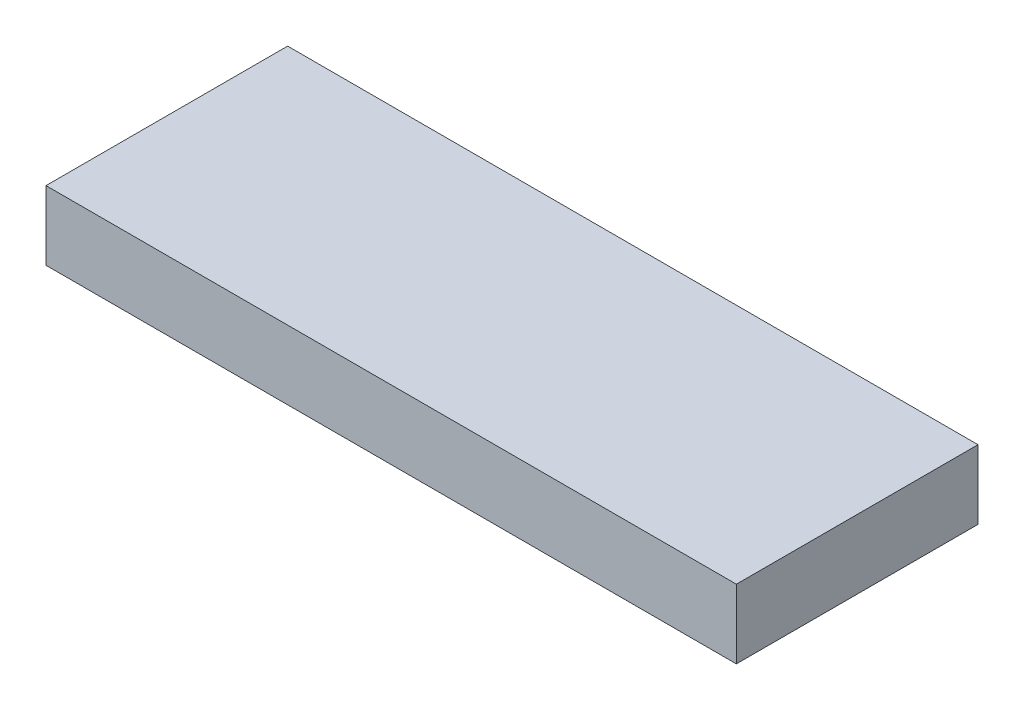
from build123d import *

# Parameters (mm, degrees)
SKETCH1_W           = 1000
SKETCH1_H           = 350
BOSS_EXTRUDE1_DEPTH = 100


with BuildPart() as part:
    # Sketch1 → Boss-Extrude1 (new body)
    with BuildSketch(Plane(origin=(0, 0, 0), x_dir=(1, 0, 0), z_dir=(0, 1, 0))):
        Rectangle(SKETCH1_W, SKETCH1_H)
    extrude(amount=BOSS_EXTRUDE1_DEPTH)


solid = part.part
